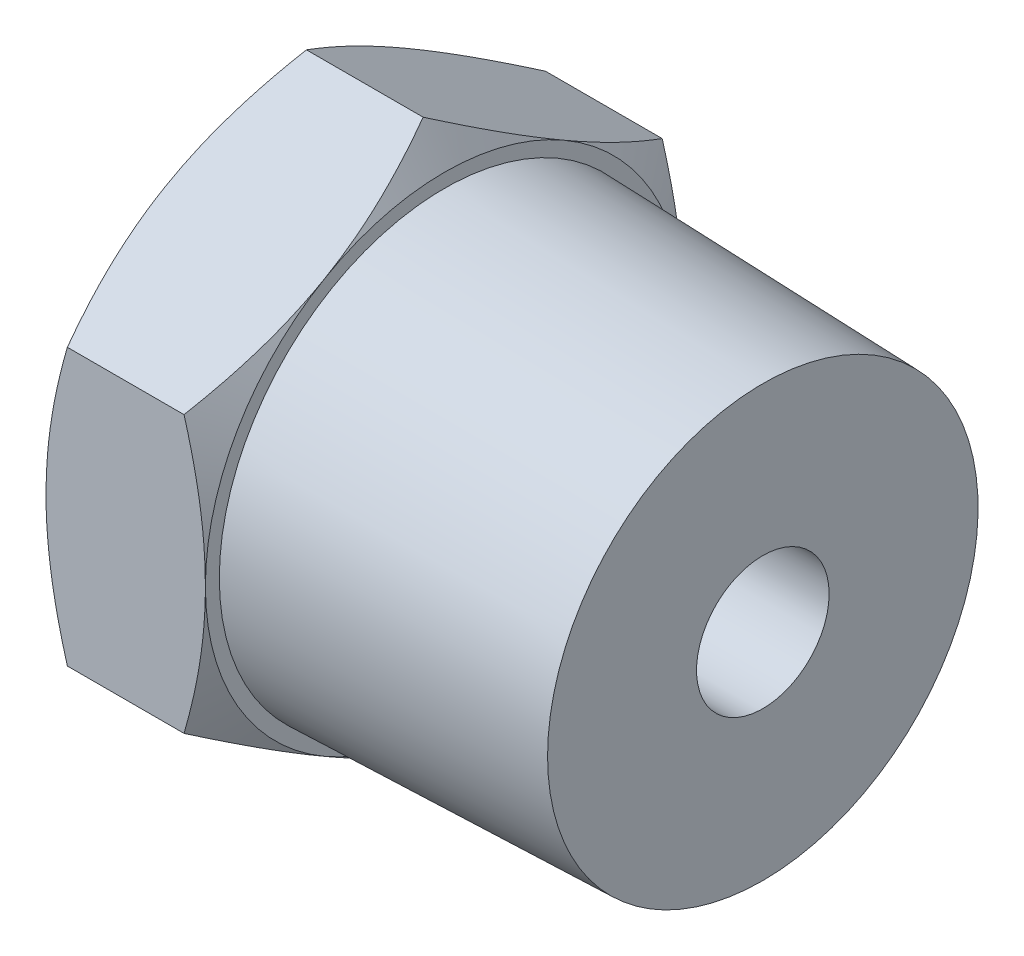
ISO-10303-21;
HEADER;
FILE_DESCRIPTION(('STEP AP214'),'2;1');
FILE_NAME('part.step','',(''),(''),'','','');
FILE_SCHEMA(('AUTOMOTIVE_DESIGN { 1 0 10303 214 1 1 1 1 }'));
ENDSEC;
DATA;
#1=APPLICATION_CONTEXT('core data for automotive mechanical design processes');
#2=APPLICATION_PROTOCOL_DEFINITION('international standard','automotive_design',2000,#1);
#3=PRODUCT_CONTEXT('',#1,'mechanical');
#4=PRODUCT('Part','Part','',(#3));
#5=PRODUCT_RELATED_PRODUCT_CATEGORY('part','',(#4));
#6=PRODUCT_DEFINITION_FORMATION('','',#4);
#7=PRODUCT_DEFINITION_CONTEXT('part definition',#1,'design');
#8=PRODUCT_DEFINITION('design','',#6,#7);
#9=PRODUCT_DEFINITION_SHAPE('','',#8);
#10=(LENGTH_UNIT() NAMED_UNIT(*) SI_UNIT(.MILLI.,.METRE.));
#11=(NAMED_UNIT(*) PLANE_ANGLE_UNIT() SI_UNIT($,.RADIAN.));
#12=(NAMED_UNIT(*) SI_UNIT($,.STERADIAN.) SOLID_ANGLE_UNIT());
#13=UNCERTAINTY_MEASURE_WITH_UNIT(LENGTH_MEASURE(1.E-05),#10,'distance_accuracy_value','');
#14=(GEOMETRIC_REPRESENTATION_CONTEXT(3) GLOBAL_UNCERTAINTY_ASSIGNED_CONTEXT((#13)) GLOBAL_UNIT_ASSIGNED_CONTEXT((#10,
#11,#12)) REPRESENTATION_CONTEXT('',''));
#15=CARTESIAN_POINT('',(0.,0.,0.));
#16=DIRECTION('',(0.,0.,1.));
#17=DIRECTION('',(1.,0.,0.));
#18=AXIS2_PLACEMENT_3D('',#15,#16,#17);
#19=CARTESIAN_POINT('',(0.,8.24889197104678,0.));
#20=DIRECTION('',(-1.,0.,0.));
#21=DIRECTION('',(0.,0.,1.));
#22=AXIS2_PLACEMENT_3D('',#19,#20,#21);
#23=PLANE('',#22);
#24=CARTESIAN_POINT('',(0.,0.,0.));
#25=DIRECTION('',(-1.,0.,0.));
#26=DIRECTION('',(0.,0.,1.));
#27=AXIS2_PLACEMENT_3D('',#24,#25,#26);
#28=CIRCLE('',#27,2.0193);
#29=CARTESIAN_POINT('',(0.,0.,2.0193));
#30=VERTEX_POINT('',#29);
#31=EDGE_CURVE('E392',#30,#30,#28,.T.);
#32=ORIENTED_EDGE('',*,*,#31,.F.);
#33=EDGE_LOOP('',(#32));
#34=FACE_BOUND('',#33,.T.);
#35=CARTESIAN_POINT('',(0.,0.,0.));
#36=DIRECTION('',(1.,0.,0.));
#37=DIRECTION('',(0.,0.,-1.));
#38=AXIS2_PLACEMENT_3D('',#35,#36,#37);
#39=CIRCLE('',#38,7.14375);
#40=CARTESIAN_POINT('',(0.,-6.18666897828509,-3.571875));
#41=VERTEX_POINT('',#40);
#42=CARTESIAN_POINT('',(0.,0.,-7.14375));
#43=VERTEX_POINT('',#42);
#44=EDGE_CURVE('E102',#41,#43,#39,.T.);
#45=ORIENTED_EDGE('',*,*,#44,.F.);
#46=CARTESIAN_POINT('',(0.,0.,0.));
#47=DIRECTION('',(1.,0.,0.));
#48=DIRECTION('',(0.,0.,-1.));
#49=AXIS2_PLACEMENT_3D('',#46,#47,#48);
#50=CIRCLE('',#49,7.14375);
#51=CARTESIAN_POINT('',(0.,-6.18666897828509,3.571875));
#52=VERTEX_POINT('',#51);
#53=EDGE_CURVE('E119',#52,#41,#50,.T.);
#54=ORIENTED_EDGE('',*,*,#53,.F.);
#55=CARTESIAN_POINT('',(0.,0.,0.));
#56=DIRECTION('',(1.,0.,0.));
#57=DIRECTION('',(0.,0.,-1.));
#58=AXIS2_PLACEMENT_3D('',#55,#56,#57);
#59=CIRCLE('',#58,7.14375);
#60=CARTESIAN_POINT('',(0.,0.,7.14375));
#61=VERTEX_POINT('',#60);
#62=EDGE_CURVE('E268',#61,#52,#59,.T.);
#63=ORIENTED_EDGE('',*,*,#62,.F.);
#64=CARTESIAN_POINT('',(0.,0.,0.));
#65=DIRECTION('',(1.,0.,0.));
#66=DIRECTION('',(0.,0.,-1.));
#67=AXIS2_PLACEMENT_3D('',#64,#65,#66);
#68=CIRCLE('',#67,7.14375);
#69=CARTESIAN_POINT('',(0.,6.18666897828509,3.571875));
#70=VERTEX_POINT('',#69);
#71=EDGE_CURVE('E271',#70,#61,#68,.T.);
#72=ORIENTED_EDGE('',*,*,#71,.F.);
#73=CARTESIAN_POINT('',(0.,0.,0.));
#74=DIRECTION('',(1.,0.,0.));
#75=DIRECTION('',(0.,0.,-1.));
#76=AXIS2_PLACEMENT_3D('',#73,#74,#75);
#77=CIRCLE('',#76,7.14375);
#78=CARTESIAN_POINT('',(0.,6.18666897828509,-3.571875));
#79=VERTEX_POINT('',#78);
#80=EDGE_CURVE('E105',#79,#70,#77,.T.);
#81=ORIENTED_EDGE('',*,*,#80,.F.);
#82=CARTESIAN_POINT('',(0.,0.,0.));
#83=DIRECTION('',(1.,0.,0.));
#84=DIRECTION('',(0.,0.,-1.));
#85=AXIS2_PLACEMENT_3D('',#82,#83,#84);
#86=CIRCLE('',#85,7.14375);
#87=EDGE_CURVE('E19',#43,#79,#86,.T.);
#88=ORIENTED_EDGE('',*,*,#87,.F.);
#89=EDGE_LOOP('',(#45,#54,#63,#72,#81,#88));
#90=FACE_BOUND('',#89,.T.);
#91=ADVANCED_FACE('F16',(#34,#90),#23,.T.);
#92=CARTESIAN_POINT('',(0.641882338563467,0.,0.));
#93=DIRECTION('',(1.,0.,0.));
#94=DIRECTION('',(0.,0.,-1.));
#95=AXIS2_PLACEMENT_3D('',#92,#93,#94);
#96=CONICAL_SURFACE('',#95,8.25552282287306,1.0471975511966);
#97=CARTESIAN_POINT('',(0.638054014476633,4.12444598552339,-7.14375));
#98=CARTESIAN_POINT('',(0.541113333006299,4.29231005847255,-6.85300089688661));
#99=CARTESIAN_POINT('',(0.452298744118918,4.4615184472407,-6.5599233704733));
#100=CARTESIAN_POINT('',(0.295675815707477,4.80142677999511,-5.97118486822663));
#101=CARTESIAN_POINT('',(0.227763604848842,4.9721148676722,-5.67554442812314));
#102=CARTESIAN_POINT('',(0.14437893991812,5.22975788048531,-5.22929363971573));
#103=CARTESIAN_POINT('',(0.119654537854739,5.31596434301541,-5.0799796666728));
#104=CARTESIAN_POINT('',(0.0768560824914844,5.4887899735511,-4.78063689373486));
#105=CARTESIAN_POINT('',(0.0587818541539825,5.57540913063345,-4.63060811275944));
#106=CARTESIAN_POINT('',(0.0296013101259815,5.74938054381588,-4.32928078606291));
#107=CARTESIAN_POINT('',(0.0185304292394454,5.8367342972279,-4.17797964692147));
#108=CARTESIAN_POINT('',(0.00371445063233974,6.011613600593,-3.87507980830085));
#109=CARTESIAN_POINT('',(-2.91962400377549E-05,6.0991391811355,-3.72348105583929));
#110=CARTESIAN_POINT('',(0.,6.18666897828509,-3.571875));
#111=B_SPLINE_CURVE_WITH_KNOTS('',3,(#97,#98,#99,#100,#101,#102,#103,#104,#105,#106,#107,#108,
#109,#110),.UNSPECIFIED.,.F.,.F.,(4,2,2,2,2,2,4),(0.,1.04875487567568,2.0922106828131,
2.61462320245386,3.1370219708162,3.66204321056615,4.18716839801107),.UNSPECIFIED.);
#112=CARTESIAN_POINT('',(0.638054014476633,4.12444598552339,-7.14375));
#113=VERTEX_POINT('',#112);
#114=EDGE_CURVE('E124',#113,#79,#111,.T.);
#115=ORIENTED_EDGE('',*,*,#114,.F.);
#116=CARTESIAN_POINT('',(0.,0.,-7.14375));
#117=CARTESIAN_POINT('',(-2.91962400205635E-05,0.175059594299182,-7.14375000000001));
#118=CARTESIAN_POINT('',(0.00371445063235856,0.350110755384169,-7.14375000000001));
#119=CARTESIAN_POINT('',(0.0185304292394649,0.699869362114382,-7.14375000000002));
#120=CARTESIAN_POINT('',(0.029601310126,0.874576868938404,-7.14375000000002));
#121=CARTESIAN_POINT('',(0.0587818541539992,1.22251969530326,-7.14375000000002));
#122=CARTESIAN_POINT('',(0.0768560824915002,1.39575800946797,-7.14375000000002));
#123=CARTESIAN_POINT('',(0.119654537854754,1.74140927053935,-7.14375000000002));
#124=CARTESIAN_POINT('',(0.144378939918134,1.91382219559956,-7.14375000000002));
#125=CARTESIAN_POINT('',(0.227763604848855,2.42910822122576,-7.14375000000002));
#126=CARTESIAN_POINT('',(0.295675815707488,2.77048439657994,-7.14375000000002));
#127=CARTESIAN_POINT('',(0.452298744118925,3.45030106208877,-7.14375000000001));
#128=CARTESIAN_POINT('',(0.541113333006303,3.78871783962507,-7.14375000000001));
#129=CARTESIAN_POINT('',(0.638054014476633,4.12444598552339,-7.14375));
#130=B_SPLINE_CURVE_WITH_KNOTS('',3,(#116,#117,#118,#119,#120,#121,#122,#123,#124,#125,#126,
#127,#128,#129),.UNSPECIFIED.,.F.,.F.,(4,2,2,2,2,2,4),(0.,0.525125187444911,1.05014642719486,
1.5725451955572,2.09495771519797,3.13841352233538,4.18716839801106),.UNSPECIFIED.);
#131=EDGE_CURVE('E121',#43,#113,#130,.T.);
#132=ORIENTED_EDGE('',*,*,#131,.F.);
#133=ORIENTED_EDGE('',*,*,#87,.T.);
#134=EDGE_LOOP('',(#115,#132,#133));
#135=FACE_BOUND('',#134,.T.);
#136=ADVANCED_FACE('F122',(#135),#96,.T.);
#137=CARTESIAN_POINT('',(0.641882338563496,0.,0.));
#138=DIRECTION('',(1.,0.,0.));
#139=DIRECTION('',(0.,0.,-1.));
#140=AXIS2_PLACEMENT_3D('',#137,#138,#139);
#141=CONICAL_SURFACE('',#140,8.25552282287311,1.0471975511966);
#142=CARTESIAN_POINT('',(0.638054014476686,-4.12444598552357,-7.14375));
#143=CARTESIAN_POINT('',(0.54111333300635,-3.78871783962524,-7.14375000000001));
#144=CARTESIAN_POINT('',(0.452298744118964,-3.45030106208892,-7.14375000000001));
#145=CARTESIAN_POINT('',(0.295675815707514,-2.77048439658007,-7.14375000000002));
#146=CARTESIAN_POINT('',(0.227763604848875,-2.42910822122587,-7.14375000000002));
#147=CARTESIAN_POINT('',(0.144378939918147,-1.91382219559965,-7.14375000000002));
#148=CARTESIAN_POINT('',(0.119654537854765,-1.74140927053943,-7.14375000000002));
#149=CARTESIAN_POINT('',(0.0768560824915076,-1.39575800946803,-7.14375000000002));
#150=CARTESIAN_POINT('',(0.0587818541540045,-1.22251969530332,-7.14375000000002));
#151=CARTESIAN_POINT('',(0.0296013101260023,-0.874576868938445,-7.14375000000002));
#152=CARTESIAN_POINT('',(0.0185304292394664,-0.699869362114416,-7.14375000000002));
#153=CARTESIAN_POINT('',(0.0037144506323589,-0.350110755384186,-7.14375000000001));
#154=CARTESIAN_POINT('',(-2.91962400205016E-05,-0.175059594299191,-7.14375000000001));
#155=CARTESIAN_POINT('',(0.,0.,-7.14375));
#156=B_SPLINE_CURVE_WITH_KNOTS('',3,(#142,#143,#144,#145,#146,#147,#148,#149,#150,#151,#152,
#153,#154,#155),.UNSPECIFIED.,.F.,.F.,(4,2,2,2,2,2,4),(0.,1.04875487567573,2.09221068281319,
2.61462320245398,3.13702197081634,3.66204321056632,4.18716839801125),.UNSPECIFIED.);
#157=CARTESIAN_POINT('',(0.638054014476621,-4.12444598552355,-7.14374999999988));
#158=VERTEX_POINT('',#157);
#159=EDGE_CURVE('E114',#158,#43,#156,.T.);
#160=ORIENTED_EDGE('',*,*,#159,.F.);
#161=CARTESIAN_POINT('',(0.,-6.18666897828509,-3.571875));
#162=CARTESIAN_POINT('',(-2.91962400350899E-05,-6.09913918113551,-3.72348105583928));
#163=CARTESIAN_POINT('',(0.00371445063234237,-6.01161360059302,-3.87507980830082));
#164=CARTESIAN_POINT('',(0.0185304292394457,-5.83673429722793,-4.17797964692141));
#165=CARTESIAN_POINT('',(0.0296013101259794,-5.74938054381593,-4.32928078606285));
#166=CARTESIAN_POINT('',(0.0587818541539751,-5.57540913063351,-4.63060811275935));
#167=CARTESIAN_POINT('',(0.076856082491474,-5.48878997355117,-4.78063689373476));
#168=CARTESIAN_POINT('',(0.119654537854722,-5.31596434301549,-5.07997966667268));
#169=CARTESIAN_POINT('',(0.144378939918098,-5.22975788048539,-5.22929363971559));
#170=CARTESIAN_POINT('',(0.227763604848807,-4.97211486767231,-5.67554442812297));
#171=CARTESIAN_POINT('',(0.29567581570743,-4.80142677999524,-5.97118486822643));
#172=CARTESIAN_POINT('',(0.452298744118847,-4.46151844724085,-6.55992337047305));
#173=CARTESIAN_POINT('',(0.541113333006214,-4.29231005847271,-6.85300089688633));
#174=CARTESIAN_POINT('',(0.638054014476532,-4.12444598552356,-7.1437499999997));
#175=B_SPLINE_CURVE_WITH_KNOTS('',3,(#161,#162,#163,#164,#165,#166,#167,#168,#169,#170,#171,
#172,#173,#174),.UNSPECIFIED.,.F.,.F.,(4,2,2,2,2,2,4),(0.,0.525125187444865,1.05014642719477,
1.57254519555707,2.09495771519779,3.13841352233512,4.1871683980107),.UNSPECIFIED.);
#176=EDGE_CURVE('E117',#41,#158,#175,.T.);
#177=ORIENTED_EDGE('',*,*,#176,.F.);
#178=ORIENTED_EDGE('',*,*,#44,.T.);
#179=EDGE_LOOP('',(#160,#177,#178));
#180=FACE_BOUND('',#179,.T.);
#181=ADVANCED_FACE('F112',(#180),#141,.T.);
#182=CARTESIAN_POINT('',(0.641882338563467,0.,0.));
#183=DIRECTION('',(1.,0.,0.));
#184=DIRECTION('',(0.,0.,-1.));
#185=AXIS2_PLACEMENT_3D('',#182,#183,#184);
#186=CONICAL_SURFACE('',#185,8.25552282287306,1.0471975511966);
#187=CARTESIAN_POINT('',(0.638054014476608,-8.24889197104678,0.));
#188=CARTESIAN_POINT('',(0.541113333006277,-8.08102789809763,-0.290749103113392));
#189=CARTESIAN_POINT('',(0.452298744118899,-7.91181950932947,-0.583826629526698));
#190=CARTESIAN_POINT('',(0.295675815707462,-7.57191117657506,-1.17256513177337));
#191=CARTESIAN_POINT('',(0.227763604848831,-7.40122308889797,-1.46820557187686));
#192=CARTESIAN_POINT('',(0.144378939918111,-7.14358007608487,-1.91445636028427));
#193=CARTESIAN_POINT('',(0.119654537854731,-7.05737361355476,-2.0637703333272));
#194=CARTESIAN_POINT('',(0.0768560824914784,-6.88454798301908,-2.36311310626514));
#195=CARTESIAN_POINT('',(0.0587818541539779,-6.79792882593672,-2.51314188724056));
#196=CARTESIAN_POINT('',(0.0296013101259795,-6.62395741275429,-2.81446921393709));
#197=CARTESIAN_POINT('',(0.0185304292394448,-6.53660365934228,-2.96577035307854));
#198=CARTESIAN_POINT('',(0.0037144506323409,-6.36172435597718,-3.26867019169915));
#199=CARTESIAN_POINT('',(-2.91962400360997E-05,-6.27419877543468,-3.42026894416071));
#200=CARTESIAN_POINT('',(0.,-6.18666897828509,-3.571875));
#201=B_SPLINE_CURVE_WITH_KNOTS('',3,(#187,#188,#189,#190,#191,#192,#193,#194,#195,#196,#197,
#198,#199,#200),.UNSPECIFIED.,.F.,.F.,(4,2,2,2,2,2,4),(0.,1.04875487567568,2.09221068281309,
2.61462320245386,3.1370219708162,3.66204321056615,4.18716839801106),.UNSPECIFIED.);
#202=CARTESIAN_POINT('',(0.638054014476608,-8.24889197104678,0.));
#203=VERTEX_POINT('',#202);
#204=EDGE_CURVE('E167',#203,#41,#201,.T.);
#205=ORIENTED_EDGE('',*,*,#204,.F.);
#206=CARTESIAN_POINT('',(0.,-6.18666897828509,3.571875));
#207=CARTESIAN_POINT('',(-2.91962400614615E-05,-6.27419877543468,3.42026894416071));
#208=CARTESIAN_POINT('',(0.00371445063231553,-6.36172435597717,3.26867019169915));
#209=CARTESIAN_POINT('',(0.0185304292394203,-6.53660365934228,2.96577035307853));
#210=CARTESIAN_POINT('',(0.029601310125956,-6.62395741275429,2.81446921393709));
#211=CARTESIAN_POINT('',(0.058781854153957,-6.79792882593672,2.51314188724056));
#212=CARTESIAN_POINT('',(0.0768560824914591,-6.88454798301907,2.36311310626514));
#213=CARTESIAN_POINT('',(0.119654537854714,-7.05737361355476,2.0637703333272));
#214=CARTESIAN_POINT('',(0.144378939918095,-7.14358007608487,1.91445636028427));
#215=CARTESIAN_POINT('',(0.227763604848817,-7.40122308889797,1.46820557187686));
#216=CARTESIAN_POINT('',(0.295675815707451,-7.57191117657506,1.17256513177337));
#217=CARTESIAN_POINT('',(0.452298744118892,-7.91181950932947,0.583826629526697));
#218=CARTESIAN_POINT('',(0.541113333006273,-8.08102789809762,0.290749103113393));
#219=CARTESIAN_POINT('',(0.638054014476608,-8.24889197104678,0.));
#220=B_SPLINE_CURVE_WITH_KNOTS('',3,(#206,#207,#208,#209,#210,#211,#212,#213,#214,#215,#216,
#217,#218,#219),.UNSPECIFIED.,.F.,.F.,(4,2,2,2,2,2,4),(0.,0.525125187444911,1.05014642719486,
1.5725451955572,2.09495771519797,3.13841352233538,4.18716839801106),.UNSPECIFIED.);
#221=EDGE_CURVE('E279',#52,#203,#220,.T.);
#222=ORIENTED_EDGE('',*,*,#221,.F.);
#223=ORIENTED_EDGE('',*,*,#53,.T.);
#224=EDGE_LOOP('',(#205,#222,#223));
#225=FACE_BOUND('',#224,.T.);
#226=ADVANCED_FACE('F157',(#225),#186,.T.);
#227=CARTESIAN_POINT('',(0.641882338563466,0.,0.));
#228=DIRECTION('',(1.,0.,0.));
#229=DIRECTION('',(0.,0.,-1.));
#230=AXIS2_PLACEMENT_3D('',#227,#228,#229);
#231=CONICAL_SURFACE('',#230,8.25552282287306,1.0471975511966);
#232=ORIENTED_EDGE('',*,*,#80,.T.);
#233=CARTESIAN_POINT('',(0.638054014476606,8.24889197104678,0.));
#234=CARTESIAN_POINT('',(0.541113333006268,8.08102789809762,0.290749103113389));
#235=CARTESIAN_POINT('',(0.452298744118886,7.91181950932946,0.583826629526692));
#236=CARTESIAN_POINT('',(0.295675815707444,7.57191117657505,1.17256513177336));
#237=CARTESIAN_POINT('',(0.227763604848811,7.40122308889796,1.46820557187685));
#238=CARTESIAN_POINT('',(0.144378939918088,7.14358007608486,1.91445636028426));
#239=CARTESIAN_POINT('',(0.119654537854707,7.05737361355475,2.06377033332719));
#240=CARTESIAN_POINT('',(0.0768560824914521,6.88454798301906,2.36311310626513));
#241=CARTESIAN_POINT('',(0.0587818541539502,6.79792882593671,2.51314188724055));
#242=CARTESIAN_POINT('',(0.029601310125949,6.62395741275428,2.81446921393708));
#243=CARTESIAN_POINT('',(0.0185304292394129,6.53660365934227,2.96577035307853));
#244=CARTESIAN_POINT('',(0.00371445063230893,6.36172435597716,3.26867019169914));
#245=CARTESIAN_POINT('',(-2.91962400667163E-05,6.27419877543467,3.42026894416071));
#246=CARTESIAN_POINT('',(0.,6.18666897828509,3.571875));
#247=B_SPLINE_CURVE_WITH_KNOTS('',3,(#233,#234,#235,#236,#237,#238,#239,#240,#241,#242,#243,
#244,#245,#246),.UNSPECIFIED.,.F.,.F.,(4,2,2,2,2,2,4),(0.,1.04875487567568,2.09221068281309,
2.61462320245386,3.1370219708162,3.66204321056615,4.18716839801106),.UNSPECIFIED.);
#248=CARTESIAN_POINT('',(0.638054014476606,8.24889197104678,0.));
#249=VERTEX_POINT('',#248);
#250=EDGE_CURVE('E322',#249,#70,#247,.T.);
#251=ORIENTED_EDGE('',*,*,#250,.F.);
#252=CARTESIAN_POINT('',(0.,6.18666897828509,-3.571875));
#253=CARTESIAN_POINT('',(-2.91962400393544E-05,6.27419877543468,-3.42026894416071));
#254=CARTESIAN_POINT('',(0.00371445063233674,6.36172435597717,-3.26867019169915));
#255=CARTESIAN_POINT('',(0.01853042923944,6.53660365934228,-2.96577035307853));
#256=CARTESIAN_POINT('',(0.029601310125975,6.62395741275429,-2.81446921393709));
#257=CARTESIAN_POINT('',(0.058781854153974,6.79792882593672,-2.51314188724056));
#258=CARTESIAN_POINT('',(0.0768560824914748,6.88454798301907,-2.36311310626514));
#259=CARTESIAN_POINT('',(0.119654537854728,7.05737361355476,-2.0637703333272));
#260=CARTESIAN_POINT('',(0.144378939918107,7.14358007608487,-1.91445636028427));
#261=CARTESIAN_POINT('',(0.227763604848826,7.40122308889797,-1.46820557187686));
#262=CARTESIAN_POINT('',(0.295675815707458,7.57191117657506,-1.17256513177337));
#263=CARTESIAN_POINT('',(0.452298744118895,7.91181950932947,-0.583826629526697));
#264=CARTESIAN_POINT('',(0.541113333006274,8.08102789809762,-0.290749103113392));
#265=CARTESIAN_POINT('',(0.638054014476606,8.24889197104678,0.));
#266=B_SPLINE_CURVE_WITH_KNOTS('',3,(#252,#253,#254,#255,#256,#257,#258,#259,#260,#261,#262,
#263,#264,#265),.UNSPECIFIED.,.F.,.F.,(4,2,2,2,2,2,4),(0.,0.52512518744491,1.05014642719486,
1.5725451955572,2.09495771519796,3.13841352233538,4.18716839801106),.UNSPECIFIED.);
#267=EDGE_CURVE('E134',#79,#249,#266,.T.);
#268=ORIENTED_EDGE('',*,*,#267,.F.);
#269=EDGE_LOOP('',(#232,#251,#268));
#270=FACE_BOUND('',#269,.T.);
#271=ADVANCED_FACE('F316',(#270),#231,.T.);
#272=CARTESIAN_POINT('',(0.641882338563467,0.,0.));
#273=DIRECTION('',(1.,0.,0.));
#274=DIRECTION('',(0.,0.,-1.));
#275=AXIS2_PLACEMENT_3D('',#272,#273,#274);
#276=CONICAL_SURFACE('',#275,8.25552282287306,1.0471975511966);
#277=CARTESIAN_POINT('',(0.638054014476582,4.12444598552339,7.14375));
#278=CARTESIAN_POINT('',(0.541113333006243,3.78871783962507,7.14374999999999));
#279=CARTESIAN_POINT('',(0.452298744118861,3.45030106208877,7.14374999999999));
#280=CARTESIAN_POINT('',(0.29567581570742,2.77048439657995,7.14374999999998));
#281=CARTESIAN_POINT('',(0.227763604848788,2.42910822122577,7.14374999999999));
#282=CARTESIAN_POINT('',(0.144378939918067,1.91382219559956,7.14374999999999));
#283=CARTESIAN_POINT('',(0.119654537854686,1.74140927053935,7.14374999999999));
#284=CARTESIAN_POINT('',(0.0768560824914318,1.39575800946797,7.14374999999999));
#285=CARTESIAN_POINT('',(0.0587818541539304,1.22251969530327,7.14374999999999));
#286=CARTESIAN_POINT('',(0.0296013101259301,0.874576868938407,7.14374999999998));
#287=CARTESIAN_POINT('',(0.0185304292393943,0.699869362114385,7.14374999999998));
#288=CARTESIAN_POINT('',(0.00371445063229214,0.350110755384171,7.14374999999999));
#289=CARTESIAN_POINT('',(-2.91962400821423E-05,0.175059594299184,7.14374999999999));
#290=CARTESIAN_POINT('',(0.,0.,7.14375));
#291=B_SPLINE_CURVE_WITH_KNOTS('',3,(#277,#278,#279,#280,#281,#282,#283,#284,#285,#286,#287,
#288,#289,#290),.UNSPECIFIED.,.F.,.F.,(4,2,2,2,2,2,4),(0.,1.04875487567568,2.0922106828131,
2.61462320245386,3.1370219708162,3.66204321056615,4.18716839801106),.UNSPECIFIED.);
#292=CARTESIAN_POINT('',(0.638054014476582,4.12444598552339,7.14375));
#293=VERTEX_POINT('',#292);
#294=EDGE_CURVE('E287',#293,#61,#291,.T.);
#295=ORIENTED_EDGE('',*,*,#294,.F.);
#296=CARTESIAN_POINT('',(0.,6.18666897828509,3.571875));
#297=CARTESIAN_POINT('',(-2.91962400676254E-05,6.09913918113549,3.72348105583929));
#298=CARTESIAN_POINT('',(0.00371445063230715,6.01161360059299,3.87507980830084));
#299=CARTESIAN_POINT('',(0.0185304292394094,5.83673429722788,4.17797964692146));
#300=CARTESIAN_POINT('',(0.0296013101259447,5.74938054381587,4.32928078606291));
#301=CARTESIAN_POINT('',(0.0587818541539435,5.57540913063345,4.63060811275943));
#302=CARTESIAN_POINT('',(0.0768560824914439,5.48878997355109,4.78063689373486));
#303=CARTESIAN_POINT('',(0.119654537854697,5.3159643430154,5.0799796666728));
#304=CARTESIAN_POINT('',(0.144378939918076,5.2297578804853,5.22929363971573));
#305=CARTESIAN_POINT('',(0.227763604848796,4.97211486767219,5.67554442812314));
#306=CARTESIAN_POINT('',(0.295675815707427,4.8014267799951,5.97118486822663));
#307=CARTESIAN_POINT('',(0.452298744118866,4.46151844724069,6.5599233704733));
#308=CARTESIAN_POINT('',(0.541113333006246,4.29231005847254,6.85300089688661));
#309=CARTESIAN_POINT('',(0.638054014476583,4.12444598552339,7.14375));
#310=B_SPLINE_CURVE_WITH_KNOTS('',3,(#296,#297,#298,#299,#300,#301,#302,#303,#304,#305,#306,
#307,#308,#309),.UNSPECIFIED.,.F.,.F.,(4,2,2,2,2,2,4),(0.,0.525125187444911,1.05014642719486,
1.5725451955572,2.09495771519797,3.13841352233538,4.18716839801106),.UNSPECIFIED.);
#311=EDGE_CURVE('E306',#70,#293,#310,.T.);
#312=ORIENTED_EDGE('',*,*,#311,.F.);
#313=ORIENTED_EDGE('',*,*,#71,.T.);
#314=EDGE_LOOP('',(#295,#312,#313));
#315=FACE_BOUND('',#314,.T.);
#316=ADVANCED_FACE('F313',(#315),#276,.T.);
#317=CARTESIAN_POINT('',(0.641882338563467,0.,0.));
#318=DIRECTION('',(1.,0.,0.));
#319=DIRECTION('',(0.,0.,-1.));
#320=AXIS2_PLACEMENT_3D('',#317,#318,#319);
#321=CONICAL_SURFACE('',#320,8.25552282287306,1.0471975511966);
#322=CARTESIAN_POINT('',(0.638054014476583,-4.1244459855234,7.14375));
#323=CARTESIAN_POINT('',(0.541113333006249,-4.29231005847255,6.85300089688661));
#324=CARTESIAN_POINT('',(0.45229874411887,-4.4615184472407,6.5599233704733));
#325=CARTESIAN_POINT('',(0.295675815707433,-4.80142677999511,5.97118486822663));
#326=CARTESIAN_POINT('',(0.227763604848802,-4.97211486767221,5.67554442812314));
#327=CARTESIAN_POINT('',(0.144378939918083,-5.22975788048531,5.22929363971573));
#328=CARTESIAN_POINT('',(0.119654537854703,-5.31596434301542,5.0799796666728));
#329=CARTESIAN_POINT('',(0.0768560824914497,-5.4887899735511,4.78063689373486));
#330=CARTESIAN_POINT('',(0.0587818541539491,-5.57540913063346,4.63060811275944));
#331=CARTESIAN_POINT('',(0.0296013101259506,-5.74938054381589,4.32928078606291));
#332=CARTESIAN_POINT('',(0.0185304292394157,-5.8367342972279,4.17797964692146));
#333=CARTESIAN_POINT('',(0.00371445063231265,-6.011613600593,3.87507980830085));
#334=CARTESIAN_POINT('',(-2.91962400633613E-05,-6.0991391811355,3.72348105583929));
#335=CARTESIAN_POINT('',(0.,-6.18666897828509,3.571875));
#336=B_SPLINE_CURVE_WITH_KNOTS('',3,(#322,#323,#324,#325,#326,#327,#328,#329,#330,#331,#332,
#333,#334,#335),.UNSPECIFIED.,.F.,.F.,(4,2,2,2,2,2,4),(0.,1.04875487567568,2.09221068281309,
2.61462320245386,3.1370219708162,3.66204321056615,4.18716839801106),.UNSPECIFIED.);
#337=CARTESIAN_POINT('',(0.638054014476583,-4.1244459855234,7.14375));
#338=VERTEX_POINT('',#337);
#339=EDGE_CURVE('E168',#338,#52,#336,.T.);
#340=ORIENTED_EDGE('',*,*,#339,.F.);
#341=CARTESIAN_POINT('',(0.,0.,7.14375));
#342=CARTESIAN_POINT('',(-2.91962400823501E-05,-0.175059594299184,7.14374999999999));
#343=CARTESIAN_POINT('',(0.00371445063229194,-0.350110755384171,7.14374999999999));
#344=CARTESIAN_POINT('',(0.0185304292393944,-0.699869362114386,7.14374999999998));
#345=CARTESIAN_POINT('',(0.0296013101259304,-0.874576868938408,7.14374999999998));
#346=CARTESIAN_POINT('',(0.0587818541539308,-1.22251969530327,7.14374999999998));
#347=CARTESIAN_POINT('',(0.0768560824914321,-1.39575800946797,7.14374999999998));
#348=CARTESIAN_POINT('',(0.119654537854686,-1.74140927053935,7.14374999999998));
#349=CARTESIAN_POINT('',(0.144378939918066,-1.91382219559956,7.14374999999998));
#350=CARTESIAN_POINT('',(0.227763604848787,-2.42910822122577,7.14374999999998));
#351=CARTESIAN_POINT('',(0.29567581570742,-2.77048439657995,7.14374999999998));
#352=CARTESIAN_POINT('',(0.452298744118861,-3.45030106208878,7.14374999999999));
#353=CARTESIAN_POINT('',(0.541113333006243,-3.78871783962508,7.14374999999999));
#354=CARTESIAN_POINT('',(0.638054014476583,-4.1244459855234,7.14375));
#355=B_SPLINE_CURVE_WITH_KNOTS('',3,(#341,#342,#343,#344,#345,#346,#347,#348,#349,#350,#351,
#352,#353,#354),.UNSPECIFIED.,.F.,.F.,(4,2,2,2,2,2,4),(0.,0.525125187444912,1.05014642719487,
1.5725451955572,2.09495771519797,3.13841352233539,4.18716839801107),.UNSPECIFIED.);
#356=EDGE_CURVE('E285',#61,#338,#355,.T.);
#357=ORIENTED_EDGE('',*,*,#356,.F.);
#358=ORIENTED_EDGE('',*,*,#62,.T.);
#359=EDGE_LOOP('',(#340,#357,#358));
#360=FACE_BOUND('',#359,.T.);
#361=ADVANCED_FACE('F252',(#360),#321,.T.);
#362=CARTESIAN_POINT('',(4.7625,8.24889197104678,0.));
#363=DIRECTION('',(0.,0.866025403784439,-0.5));
#364=DIRECTION('',(0.,-0.5,-0.866025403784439));
#365=AXIS2_PLACEMENT_3D('',#362,#363,#364);
#366=PLANE('',#365);
#367=ORIENTED_EDGE('',*,*,#114,.T.);
#368=ORIENTED_EDGE('',*,*,#267,.T.);
#369=DIRECTION('',(-1.,0.,0.));
#370=VECTOR('',#369,1.);
#371=CARTESIAN_POINT('',(4.7625,8.24889197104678,0.));
#372=LINE('',#371,#370);
#373=CARTESIAN_POINT('',(4.12444598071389,8.24889197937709,-1.44285053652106E-08));
#374=VERTEX_POINT('',#373);
#375=EDGE_CURVE('E327',#374,#249,#372,.T.);
#376=ORIENTED_EDGE('',*,*,#375,.F.);
#377=CARTESIAN_POINT('',(4.7625,6.18666897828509,-3.571875));
#378=CARTESIAN_POINT('',(4.76252919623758,6.27419877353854,-3.42026894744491));
#379=CARTESIAN_POINT('',(4.75878554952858,6.36172435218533,-3.2686701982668));
#380=CARTESIAN_POINT('',(4.74396957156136,6.53660365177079,-2.96577036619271));
#381=CARTESIAN_POINT('',(4.73289869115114,6.62395740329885,-2.81446923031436));
#382=CARTESIAN_POINT('',(4.70371814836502,6.79792881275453,-2.51314191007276));
#383=CARTESIAN_POINT('',(4.68564392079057,6.88454796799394,-2.36311313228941));
#384=CARTESIAN_POINT('',(4.64284546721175,7.05737359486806,-2.0637703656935));
#385=CARTESIAN_POINT('',(4.61812106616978,7.14358005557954,-1.91445639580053));
#386=CARTESIAN_POINT('',(4.53473640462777,7.401223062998,-1.4682056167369));
#387=CARTESIAN_POINT('',(4.46682419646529,7.57191114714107,-1.17256518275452));
#388=CARTESIAN_POINT('',(4.310201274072,7.91181947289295,-0.583826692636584));
#389=CARTESIAN_POINT('',(4.22138668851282,8.08102785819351,-0.29074917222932));
#390=CARTESIAN_POINT('',(4.12444601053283,8.24889192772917,-7.5028281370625E-08));
#391=B_SPLINE_CURVE_WITH_KNOTS('',3,(#377,#378,#379,#380,#381,#382,#383,#384,#385,#386,#387,
#388,#389,#390),.UNSPECIFIED.,.F.,.F.,(4,2,2,2,2,2,4),(0.,0.525125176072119,1.05014640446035,
1.57254516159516,2.09495767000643,3.13841345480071,4.18716830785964),.UNSPECIFIED.);
#392=CARTESIAN_POINT('',(4.7625,6.18666897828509,-3.571875));
#393=VERTEX_POINT('',#392);
#394=EDGE_CURVE('E258',#393,#374,#391,.T.);
#395=ORIENTED_EDGE('',*,*,#394,.F.);
#396=CARTESIAN_POINT('',(4.12444601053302,4.12444602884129,-7.14374992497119));
#397=CARTESIAN_POINT('',(4.22138668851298,4.29231009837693,-6.85300082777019));
#398=CARTESIAN_POINT('',(4.31020127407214,4.46151848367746,-6.55992330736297));
#399=CARTESIAN_POINT('',(4.46682419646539,4.8014268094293,-5.97118481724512));
#400=CARTESIAN_POINT('',(4.53473640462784,4.97211489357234,-5.67554438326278));
#401=CARTESIAN_POINT('',(4.61812106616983,5.22975790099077,-5.22929360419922));
#402=CARTESIAN_POINT('',(4.6428454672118,5.31596436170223,-5.07997963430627));
#403=CARTESIAN_POINT('',(4.6856439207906,5.48878998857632,-4.7806368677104));
#404=CARTESIAN_POINT('',(4.70371814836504,5.57540914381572,-4.63060808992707));
#405=CARTESIAN_POINT('',(4.73289869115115,5.74938055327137,-4.32928076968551));
#406=CARTESIAN_POINT('',(4.74396957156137,5.83673430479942,-4.17797963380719));
#407=CARTESIAN_POINT('',(4.75878554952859,6.01161360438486,-3.87507980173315));
#408=CARTESIAN_POINT('',(4.76252919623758,6.09913918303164,-3.72348105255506));
#409=CARTESIAN_POINT('',(4.7625,6.18666897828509,-3.571875));
#410=B_SPLINE_CURVE_WITH_KNOTS('',3,(#396,#397,#398,#399,#400,#401,#402,#403,#404,#405,#406,
#407,#408,#409),.UNSPECIFIED.,.F.,.F.,(4,2,2,2,2,2,4),(0.,1.04875485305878,2.0922106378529,
2.61462314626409,3.13702190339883,3.66204313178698,4.18716830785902),.UNSPECIFIED.);
#411=CARTESIAN_POINT('',(4.12444599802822,4.12444600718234,-7.14374996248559));
#412=VERTEX_POINT('',#411);
#413=EDGE_CURVE('E238',#412,#393,#410,.T.);
#414=ORIENTED_EDGE('',*,*,#413,.F.);
#415=DIRECTION('',(-1.,0.,0.));
#416=VECTOR('',#415,1.);
#417=CARTESIAN_POINT('',(4.7625,4.12444598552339,-7.14375));
#418=LINE('',#417,#416);
#419=EDGE_CURVE('E132',#113,#412,#418,.F.);
#420=ORIENTED_EDGE('',*,*,#419,.F.);
#421=EDGE_LOOP('',(#367,#368,#376,#395,#414,#420));
#422=FACE_BOUND('',#421,.T.);
#423=ADVANCED_FACE('F249',(#422),#366,.T.);
#424=CARTESIAN_POINT('',(4.7625,4.12444598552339,-7.14375));
#425=DIRECTION('',(0.,0.,-1.));
#426=DIRECTION('',(-1.,0.,0.));
#427=AXIS2_PLACEMENT_3D('',#424,#425,#426);
#428=PLANE('',#427);
#429=ORIENTED_EDGE('',*,*,#159,.T.);
#430=ORIENTED_EDGE('',*,*,#131,.T.);
#431=ORIENTED_EDGE('',*,*,#419,.T.);
#432=CARTESIAN_POINT('',(4.7625,0.,-7.14375));
#433=CARTESIAN_POINT('',(4.76252919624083,0.175059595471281,-7.14375));
#434=CARTESIAN_POINT('',(4.75878554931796,0.350110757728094,-7.14375));
#435=CARTESIAN_POINT('',(4.74396957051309,0.699869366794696,-7.14375));
#436=CARTESIAN_POINT('',(4.73289868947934,0.874576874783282,-7.14375));
#437=CARTESIAN_POINT('',(4.7037181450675,1.22251970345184,-7.14375));
#438=CARTESIAN_POINT('',(4.68564391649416,1.39575801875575,-7.14375));
#439=CARTESIAN_POINT('',(4.64284546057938,1.74140928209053,-7.14375));
#440=CARTESIAN_POINT('',(4.61812105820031,1.91382220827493,-7.14375));
#441=CARTESIAN_POINT('',(4.53473639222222,2.42910823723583,-7.14375));
#442=CARTESIAN_POINT('',(4.46682418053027,2.77048441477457,-7.14375));
#443=CARTESIAN_POINT('',(4.31020125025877,3.45030108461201,-7.14375));
#444=CARTESIAN_POINT('',(4.22138666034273,3.7887178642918,-7.14375));
#445=CARTESIAN_POINT('',(4.12444597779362,4.12444601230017,-7.14375));
#446=B_SPLINE_CURVE_WITH_KNOTS('',3,(#432,#433,#434,#435,#436,#437,#438,#439,#440,#441,#442,
#443,#444,#445),.UNSPECIFIED.,.F.,.F.,(4,2,2,2,2,2,4),(0.,0.525125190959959,1.05014643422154,
1.57254520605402,2.09495772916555,3.13841354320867,4.18716842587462),.UNSPECIFIED.);
#447=CARTESIAN_POINT('',(4.7625,0.,-7.14375));
#448=VERTEX_POINT('',#447);
#449=EDGE_CURVE('E232',#448,#412,#446,.T.);
#450=ORIENTED_EDGE('',*,*,#449,.F.);
#451=CARTESIAN_POINT('',(4.12444601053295,-4.12444589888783,-7.14375));
#452=CARTESIAN_POINT('',(4.22138668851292,-3.78871775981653,-7.14375));
#453=CARTESIAN_POINT('',(4.31020127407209,-3.45030098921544,-7.14375));
#454=CARTESIAN_POINT('',(4.46682419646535,-2.77048433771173,-7.14375));
#455=CARTESIAN_POINT('',(4.53473640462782,-2.42910816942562,-7.14375));
#456=CARTESIAN_POINT('',(4.61812106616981,-1.91382215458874,-7.14375));
#457=CARTESIAN_POINT('',(4.64284546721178,-1.7414092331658,-7.14375));
#458=CARTESIAN_POINT('',(4.68564392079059,-1.3957579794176,-7.14375));
#459=CARTESIAN_POINT('',(4.70371814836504,-1.22251966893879,-7.14375));
#460=CARTESIAN_POINT('',(4.73289869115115,-0.874576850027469,-7.14375));
#461=CARTESIAN_POINT('',(4.74396957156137,-0.699869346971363,-7.14375));
#462=CARTESIAN_POINT('',(4.75878554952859,-0.350110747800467,-7.14375));
#463=CARTESIAN_POINT('',(4.76252919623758,-0.175059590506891,-7.14375));
#464=CARTESIAN_POINT('',(4.7625,0.,-7.14375));
#465=B_SPLINE_CURVE_WITH_KNOTS('',3,(#451,#452,#453,#454,#455,#456,#457,#458,#459,#460,#461,
#462,#463,#464),.UNSPECIFIED.,.F.,.F.,(4,2,2,2,2,2,4),(0.,1.04875485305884,2.09221063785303,
2.61462314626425,3.13702190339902,3.6620431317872,4.18716830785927),.UNSPECIFIED.);
#466=CARTESIAN_POINT('',(4.12444599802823,-4.12444594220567,-7.14374999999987));
#467=VERTEX_POINT('',#466);
#468=EDGE_CURVE('E226',#467,#448,#465,.T.);
#469=ORIENTED_EDGE('',*,*,#468,.F.);
#470=DIRECTION('',(-1.,0.,0.));
#471=VECTOR('',#470,1.);
#472=CARTESIAN_POINT('',(4.7625,-4.12444598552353,-7.14374999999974));
#473=LINE('',#472,#471);
#474=EDGE_CURVE('E128',#158,#467,#473,.F.);
#475=ORIENTED_EDGE('',*,*,#474,.F.);
#476=EDGE_LOOP('',(#429,#430,#431,#450,#469,#475));
#477=FACE_BOUND('',#476,.T.);
#478=ADVANCED_FACE('F130',(#477),#428,.T.);
#479=CARTESIAN_POINT('',(4.7625,-4.12444598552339,-7.14375));
#480=DIRECTION('',(0.,-0.866025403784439,-0.5));
#481=DIRECTION('',(0.,-0.5,0.866025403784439));
#482=AXIS2_PLACEMENT_3D('',#479,#480,#481);
#483=PLANE('',#482);
#484=ORIENTED_EDGE('',*,*,#204,.T.);
#485=ORIENTED_EDGE('',*,*,#176,.T.);
#486=ORIENTED_EDGE('',*,*,#474,.T.);
#487=CARTESIAN_POINT('',(4.7625,-6.18666897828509,-3.571875));
#488=CARTESIAN_POINT('',(4.76252919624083,-6.09913918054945,-3.72348105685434));
#489=CARTESIAN_POINT('',(4.75878554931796,-6.01161359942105,-3.87507981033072));
#490=CARTESIAN_POINT('',(4.74396957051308,-5.83673429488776,-4.17797965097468));
#491=CARTESIAN_POINT('',(4.73289868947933,-5.74938054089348,-4.32928079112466));
#492=CARTESIAN_POINT('',(4.7037181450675,-5.57540912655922,-4.63060811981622));
#493=CARTESIAN_POINT('',(4.68564391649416,-5.48878996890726,-4.78063690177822));
#494=CARTESIAN_POINT('',(4.64284546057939,-5.31596433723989,-5.0799796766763));
#495=CARTESIAN_POINT('',(4.61812105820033,-5.22975787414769,-5.22929365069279));
#496=CARTESIAN_POINT('',(4.53473639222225,-4.97211485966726,-5.6755444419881));
#497=CARTESIAN_POINT('',(4.46682418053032,-4.80142677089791,-5.97118488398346));
#498=CARTESIAN_POINT('',(4.31020125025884,-4.46151843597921,-6.55992338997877));
#499=CARTESIAN_POINT('',(4.22138666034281,-4.29231004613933,-6.85300091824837));
#500=CARTESIAN_POINT('',(4.12444597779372,-4.12444597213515,-7.1437500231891));
#501=B_SPLINE_CURVE_WITH_KNOTS('',3,(#487,#488,#489,#490,#491,#492,#493,#494,#495,#496,#497,
#498,#499,#500),.UNSPECIFIED.,.F.,.F.,(4,2,2,2,2,2,4),(0.,0.525125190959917,1.05014643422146,
1.5725452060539,2.09495772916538,3.13841354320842,4.18716842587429),.UNSPECIFIED.);
#502=CARTESIAN_POINT('',(4.7625,-6.18666897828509,-3.571875));
#503=VERTEX_POINT('',#502);
#504=EDGE_CURVE('E188',#503,#467,#501,.T.);
#505=ORIENTED_EDGE('',*,*,#504,.F.);
#506=CARTESIAN_POINT('',(4.12444601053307,-8.24889192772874,-7.50290258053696E-08));
#507=CARTESIAN_POINT('',(4.22138668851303,-8.08102785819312,-0.290749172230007));
#508=CARTESIAN_POINT('',(4.31020127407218,-7.91181947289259,-0.583826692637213));
#509=CARTESIAN_POINT('',(4.46682419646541,-7.57191114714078,-1.17256518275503));
#510=CARTESIAN_POINT('',(4.53473640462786,-7.40122306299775,-1.46820561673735));
#511=CARTESIAN_POINT('',(4.61812106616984,-7.14358005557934,-1.91445639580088));
#512=CARTESIAN_POINT('',(4.6428454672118,-7.05737359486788,-2.06377036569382));
#513=CARTESIAN_POINT('',(4.6856439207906,-6.8845479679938,-2.36311313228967));
#514=CARTESIAN_POINT('',(4.70371814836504,-6.79792881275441,-2.51314191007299));
#515=CARTESIAN_POINT('',(4.73289869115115,-6.62395740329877,-2.81446923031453));
#516=CARTESIAN_POINT('',(4.74396957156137,-6.53660365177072,-2.96577036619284));
#517=CARTESIAN_POINT('',(4.75878554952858,-6.3617243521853,-3.26867019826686));
#518=CARTESIAN_POINT('',(4.76252919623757,-6.27419877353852,-3.42026894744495));
#519=CARTESIAN_POINT('',(4.7625,-6.18666897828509,-3.571875));
#520=B_SPLINE_CURVE_WITH_KNOTS('',3,(#506,#507,#508,#509,#510,#511,#512,#513,#514,#515,#516,
#517,#518,#519),.UNSPECIFIED.,.F.,.F.,(4,2,2,2,2,2,4),(0.,1.04875485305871,2.09221063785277,
2.61462314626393,3.13702190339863,3.66204313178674,4.18716830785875),.UNSPECIFIED.);
#521=CARTESIAN_POINT('',(4.12444599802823,-8.24889194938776,-3.7514506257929E-08));
#522=VERTEX_POINT('',#521);
#523=EDGE_CURVE('E196',#522,#503,#520,.T.);
#524=ORIENTED_EDGE('',*,*,#523,.F.);
#525=DIRECTION('',(-1.,0.,0.));
#526=VECTOR('',#525,1.);
#527=CARTESIAN_POINT('',(4.7625,-8.24889197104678,0.));
#528=LINE('',#527,#526);
#529=EDGE_CURVE('E166',#203,#522,#528,.F.);
#530=ORIENTED_EDGE('',*,*,#529,.F.);
#531=EDGE_LOOP('',(#484,#485,#486,#505,#524,#530));
#532=FACE_BOUND('',#531,.T.);
#533=ADVANCED_FACE('F178',(#532),#483,.T.);
#534=CARTESIAN_POINT('',(4.7625,-8.24889197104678,0.));
#535=DIRECTION('',(0.,-0.866025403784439,0.5));
#536=DIRECTION('',(0.,0.5,0.866025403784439));
#537=AXIS2_PLACEMENT_3D('',#534,#535,#536);
#538=PLANE('',#537);
#539=ORIENTED_EDGE('',*,*,#339,.T.);
#540=ORIENTED_EDGE('',*,*,#221,.T.);
#541=ORIENTED_EDGE('',*,*,#529,.T.);
#542=CARTESIAN_POINT('',(4.7625,-6.18666897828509,3.571875));
#543=CARTESIAN_POINT('',(4.76252919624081,-6.27419877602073,3.42026894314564));
#544=CARTESIAN_POINT('',(4.75878554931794,-6.36172435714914,3.26867018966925));
#545=CARTESIAN_POINT('',(4.74396957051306,-6.53660366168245,2.96577034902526));
#546=CARTESIAN_POINT('',(4.73289868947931,-6.62395741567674,2.81446920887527));
#547=CARTESIAN_POINT('',(4.70371814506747,-6.79792883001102,2.51314188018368));
#548=CARTESIAN_POINT('',(4.68564391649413,-6.88454798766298,2.36311309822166));
#549=CARTESIAN_POINT('',(4.64284546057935,-7.05737361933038,2.06377032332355));
#550=CARTESIAN_POINT('',(4.61812105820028,-7.14358008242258,1.91445634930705));
#551=CARTESIAN_POINT('',(4.53473639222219,-7.40122309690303,1.4682055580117));
#552=CARTESIAN_POINT('',(4.46682418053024,-7.5719111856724,1.17256511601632));
#553=CARTESIAN_POINT('',(4.31020125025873,-7.91181952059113,0.583826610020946));
#554=CARTESIAN_POINT('',(4.22138666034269,-8.08102791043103,0.290749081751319));
#555=CARTESIAN_POINT('',(4.12444597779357,-8.24889198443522,-2.31894383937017E-08));
#556=B_SPLINE_CURVE_WITH_KNOTS('',3,(#542,#543,#544,#545,#546,#547,#548,#549,#550,#551,#552,
#553,#554,#555),.UNSPECIFIED.,.F.,.F.,(4,2,2,2,2,2,4),(0.,0.525125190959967,1.05014643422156,
1.57254520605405,2.09495772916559,3.13841354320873,4.1871684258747),.UNSPECIFIED.);
#557=CARTESIAN_POINT('',(4.7625,-6.18666897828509,3.571875));
#558=VERTEX_POINT('',#557);
#559=EDGE_CURVE('E203',#558,#522,#556,.T.);
#560=ORIENTED_EDGE('',*,*,#559,.F.);
#561=CARTESIAN_POINT('',(4.12444595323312,-4.12444593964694,7.14375000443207));
#562=CARTESIAN_POINT('',(4.22138665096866,-4.29231003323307,6.85300091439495));
#563=CARTESIAN_POINT('',(4.31020124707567,-4.46151843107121,6.55992339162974));
#564=CARTESIAN_POINT('',(4.46682418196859,-4.80142677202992,5.97118488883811));
#565=CARTESIAN_POINT('',(4.53473639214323,-4.97211485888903,5.675544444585));
#566=CARTESIAN_POINT('',(4.61812105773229,-5.229757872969,5.22929365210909));
#567=CARTESIAN_POINT('',(4.642845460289,-5.31596433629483,5.07997967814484));
#568=CARTESIAN_POINT('',(4.6856439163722,-5.48878996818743,4.78063690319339));
#569=CARTESIAN_POINT('',(4.70371814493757,-5.5754091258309,4.63060812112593));
#570=CARTESIAN_POINT('',(4.73289868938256,-5.74938054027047,4.32928079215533));
#571=CARTESIAN_POINT('',(4.74396957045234,-5.83673429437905,4.1779796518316));
#572=CARTESIAN_POINT('',(4.75878554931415,-6.0116135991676,3.87507981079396));
#573=CARTESIAN_POINT('',(4.76252919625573,-6.09913918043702,3.72348105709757));
#574=CARTESIAN_POINT('',(4.7625,-6.18666897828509,3.571875));
#575=B_SPLINE_CURVE_WITH_KNOTS('',3,(#561,#562,#563,#564,#565,#566,#567,#568,#569,#570,#571,
#572,#573,#574),.UNSPECIFIED.,.F.,.F.,(4,2,2,2,2,2,4),(0.,1.04875488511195,2.09221070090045,
2.61462322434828,3.13702199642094,3.66204324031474,4.18716843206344),.UNSPECIFIED.);
#576=CARTESIAN_POINT('',(4.12444598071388,-4.12444597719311,7.14375001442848));
#577=VERTEX_POINT('',#576);
#578=EDGE_CURVE('E347',#577,#558,#575,.T.);
#579=ORIENTED_EDGE('',*,*,#578,.F.);
#580=DIRECTION('',(-1.,0.,0.));
#581=VECTOR('',#580,1.);
#582=CARTESIAN_POINT('',(4.7625,-4.1244459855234,7.14375));
#583=LINE('',#582,#581);
#584=EDGE_CURVE('E296',#338,#577,#583,.F.);
#585=ORIENTED_EDGE('',*,*,#584,.F.);
#586=EDGE_LOOP('',(#539,#540,#541,#560,#579,#585));
#587=FACE_BOUND('',#586,.T.);
#588=ADVANCED_FACE('F181',(#587),#538,.T.);
#589=CARTESIAN_POINT('',(4.7625,4.12444598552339,7.14375));
#590=DIRECTION('',(0.,0.866025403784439,0.5));
#591=DIRECTION('',(0.,0.5,-0.866025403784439));
#592=AXIS2_PLACEMENT_3D('',#589,#590,#591);
#593=PLANE('',#592);
#594=ORIENTED_EDGE('',*,*,#250,.T.);
#595=ORIENTED_EDGE('',*,*,#311,.T.);
#596=DIRECTION('',(-1.,0.,0.));
#597=VECTOR('',#596,1.);
#598=CARTESIAN_POINT('',(4.7625,4.12444598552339,7.14375));
#599=LINE('',#598,#597);
#600=CARTESIAN_POINT('',(4.12444598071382,4.12444600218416,7.14375));
#601=VERTEX_POINT('',#600);
#602=EDGE_CURVE('E292',#601,#293,#599,.T.);
#603=ORIENTED_EDGE('',*,*,#602,.F.);
#604=CARTESIAN_POINT('',(4.7625,6.18666897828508,3.571875));
#605=CARTESIAN_POINT('',(4.76252919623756,6.09913918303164,3.72348105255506));
#606=CARTESIAN_POINT('',(4.75878554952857,6.01161360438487,3.87507980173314));
#607=CARTESIAN_POINT('',(4.74396957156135,5.83673430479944,4.17797963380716));
#608=CARTESIAN_POINT('',(4.73289869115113,5.74938055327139,4.32928076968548));
#609=CARTESIAN_POINT('',(4.70371814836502,5.57540914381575,4.63060808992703));
#610=CARTESIAN_POINT('',(4.68564392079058,5.48878998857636,4.78063686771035));
#611=CARTESIAN_POINT('',(4.64284546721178,5.31596436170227,5.07997963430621));
#612=CARTESIAN_POINT('',(4.61812106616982,5.22975790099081,5.22929360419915));
#613=CARTESIAN_POINT('',(4.53473640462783,4.9721148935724,5.67554438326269));
#614=CARTESIAN_POINT('',(4.46682419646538,4.80142680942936,5.97118481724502));
#615=CARTESIAN_POINT('',(4.31020127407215,4.46151848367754,6.55992330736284));
#616=CARTESIAN_POINT('',(4.22138668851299,4.29231009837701,6.85300082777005));
#617=CARTESIAN_POINT('',(4.12444601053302,4.12444602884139,7.14374992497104));
#618=B_SPLINE_CURVE_WITH_KNOTS('',3,(#604,#605,#606,#607,#608,#609,#610,#611,#612,#613,#614,
#615,#616,#617),.UNSPECIFIED.,.F.,.F.,(4,2,2,2,2,2,4),(0.,0.525125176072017,1.05014640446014,
1.57254516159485,2.09495767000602,3.1384134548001,4.18716830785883),.UNSPECIFIED.);
#619=CARTESIAN_POINT('',(4.7625,6.18666897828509,3.571875));
#620=VERTEX_POINT('',#619);
#621=EDGE_CURVE('E339',#620,#601,#618,.T.);
#622=ORIENTED_EDGE('',*,*,#621,.F.);
#623=CARTESIAN_POINT('',(4.12444597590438,8.2488919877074,-2.88570230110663E-08));
#624=CARTESIAN_POINT('',(4.22138665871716,8.08102791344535,0.290749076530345));
#625=CARTESIAN_POINT('',(4.31020124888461,7.91181952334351,0.583826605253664));
#626=CARTESIAN_POINT('',(4.46682417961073,7.57191118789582,1.17256511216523));
#627=CARTESIAN_POINT('',(4.53473639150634,7.40122309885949,1.46820555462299));
#628=CARTESIAN_POINT('',(4.61812105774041,7.14358008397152,1.91445634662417));
#629=CARTESIAN_POINT('',(4.64284546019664,7.05737362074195,2.06377032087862));
#630=CARTESIAN_POINT('',(4.68564391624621,6.88454798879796,2.3631130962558));
#631=CARTESIAN_POINT('',(4.7037181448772,6.79792883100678,2.51314187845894));
#632=CARTESIAN_POINT('',(4.73289868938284,6.62395741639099,2.81446920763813));
#633=CARTESIAN_POINT('',(4.74396957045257,6.53660366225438,2.96577034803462));
#634=CARTESIAN_POINT('',(4.75878554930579,6.36172435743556,3.26867018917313));
#635=CARTESIAN_POINT('',(4.762529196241,6.27419877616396,3.42026894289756));
#636=CARTESIAN_POINT('',(4.7625,6.18666897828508,3.571875));
#637=B_SPLINE_CURVE_WITH_KNOTS('',3,(#623,#624,#625,#626,#627,#628,#629,#630,#631,#632,#633,
#634,#635,#636),.UNSPECIFIED.,.F.,.F.,(4,2,2,2,2,2,4),(0.,1.04875488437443,2.09221070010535,
2.61462322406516,3.13702199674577,3.66204324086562,4.18716843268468),.UNSPECIFIED.);
#638=EDGE_CURVE('E244',#374,#620,#637,.T.);
#639=ORIENTED_EDGE('',*,*,#638,.F.);
#640=ORIENTED_EDGE('',*,*,#375,.T.);
#641=EDGE_LOOP('',(#594,#595,#603,#622,#639,#640));
#642=FACE_BOUND('',#641,.T.);
#643=ADVANCED_FACE('F331',(#642),#593,.T.);
#644=CARTESIAN_POINT('',(4.7625,-4.1244459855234,7.14375));
#645=DIRECTION('',(0.,0.,1.));
#646=DIRECTION('',(0.,1.,0.));
#647=AXIS2_PLACEMENT_3D('',#644,#645,#646);
#648=PLANE('',#647);
#649=ORIENTED_EDGE('',*,*,#294,.T.);
#650=ORIENTED_EDGE('',*,*,#356,.T.);
#651=ORIENTED_EDGE('',*,*,#584,.T.);
#652=CARTESIAN_POINT('',(4.7625,0.,7.14375));
#653=CARTESIAN_POINT('',(4.76252919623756,-0.175059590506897,7.14375));
#654=CARTESIAN_POINT('',(4.75878554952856,-0.350110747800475,7.14375));
#655=CARTESIAN_POINT('',(4.74396957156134,-0.699869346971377,7.14375));
#656=CARTESIAN_POINT('',(4.73289869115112,-0.874576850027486,7.14375));
#657=CARTESIAN_POINT('',(4.703718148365,-1.22251966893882,7.14375));
#658=CARTESIAN_POINT('',(4.68564392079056,-1.39575797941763,7.14375));
#659=CARTESIAN_POINT('',(4.64284546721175,-1.74140923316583,7.14375));
#660=CARTESIAN_POINT('',(4.61812106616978,-1.91382215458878,7.14375));
#661=CARTESIAN_POINT('',(4.53473640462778,-2.42910816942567,7.14375));
#662=CARTESIAN_POINT('',(4.46682419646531,-2.77048433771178,7.14375));
#663=CARTESIAN_POINT('',(4.31020127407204,-3.4503009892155,7.14375));
#664=CARTESIAN_POINT('',(4.22138668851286,-3.7887177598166,7.14375));
#665=CARTESIAN_POINT('',(4.12444601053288,-4.1244458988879,7.14375));
#666=B_SPLINE_CURVE_WITH_KNOTS('',3,(#652,#653,#654,#655,#656,#657,#658,#659,#660,#661,#662,
#663,#664,#665),.UNSPECIFIED.,.F.,.F.,(4,2,2,2,2,2,4),(0.,0.525125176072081,1.05014640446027,
1.57254516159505,2.09495767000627,3.13841345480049,4.18716830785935),.UNSPECIFIED.);
#667=CARTESIAN_POINT('',(4.7625,0.,7.14375));
#668=VERTEX_POINT('',#667);
#669=EDGE_CURVE('E34',#668,#577,#666,.T.);
#670=ORIENTED_EDGE('',*,*,#669,.F.);
#671=CARTESIAN_POINT('',(4.12444597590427,4.12444601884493,7.14375));
#672=CARTESIAN_POINT('',(4.22138665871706,3.78871787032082,7.14375));
#673=CARTESIAN_POINT('',(4.31020124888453,3.45030109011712,7.14375));
#674=CARTESIAN_POINT('',(4.46682417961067,2.77048441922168,7.14375));
#675=CARTESIAN_POINT('',(4.53473639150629,2.429108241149,7.14375));
#676=CARTESIAN_POINT('',(4.61812105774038,1.91382221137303,7.14375));
#677=CARTESIAN_POINT('',(4.64284546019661,1.74140928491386,7.14375));
#678=CARTESIAN_POINT('',(4.68564391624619,1.39575802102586,7.14375));
#679=CARTESIAN_POINT('',(4.70371814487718,1.2225197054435,7.14375));
#680=CARTESIAN_POINT('',(4.73289868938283,0.874576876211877,7.14375));
#681=CARTESIAN_POINT('',(4.74396957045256,0.69986936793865,7.14375));
#682=CARTESIAN_POINT('',(4.75878554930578,0.350110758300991,7.14375));
#683=CARTESIAN_POINT('',(4.762529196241,0.175059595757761,7.14375));
#684=CARTESIAN_POINT('',(4.7625,0.,7.14375));
#685=B_SPLINE_CURVE_WITH_KNOTS('',3,(#671,#672,#673,#674,#675,#676,#677,#678,#679,#680,#681,
#682,#683,#684),.UNSPECIFIED.,.F.,.F.,(4,2,2,2,2,2,4),(0.,1.04875488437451,2.09221070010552,
2.61462322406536,3.13702199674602,3.66204324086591,4.18716843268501),.UNSPECIFIED.);
#686=EDGE_CURVE('E346',#601,#668,#685,.T.);
#687=ORIENTED_EDGE('',*,*,#686,.F.);
#688=ORIENTED_EDGE('',*,*,#602,.T.);
#689=EDGE_LOOP('',(#649,#650,#651,#670,#687,#688));
#690=FACE_BOUND('',#689,.T.);
#691=ADVANCED_FACE('F290',(#690),#648,.T.);
#692=CARTESIAN_POINT('',(14.2748,0.,0.));
#693=DIRECTION('',(1.,0.,0.));
#694=DIRECTION('',(0.,0.,-1.));
#695=AXIS2_PLACEMENT_3D('',#692,#693,#694);
#696=PLANE('',#695);
#697=CARTESIAN_POINT('',(14.2748,0.,0.));
#698=DIRECTION('',(1.,0.,0.));
#699=DIRECTION('',(0.,0.,-1.));
#700=AXIS2_PLACEMENT_3D('',#697,#698,#699);
#701=CIRCLE('',#700,1.9812);
#702=CARTESIAN_POINT('',(14.2748,0.,-1.98119999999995));
#703=VERTEX_POINT('',#702);
#704=EDGE_CURVE('E389',#703,#703,#701,.T.);
#705=ORIENTED_EDGE('',*,*,#704,.F.);
#706=EDGE_LOOP('',(#705));
#707=FACE_BOUND('',#706,.T.);
#708=CARTESIAN_POINT('',(14.2748000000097,0.,0.));
#709=DIRECTION('',(-1.,0.,0.));
#710=DIRECTION('',(0.,-1.,0.));
#711=AXIS2_PLACEMENT_3D('',#708,#709,#710);
#712=CIRCLE('',#711,6.43170674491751);
#713=CARTESIAN_POINT('',(14.2748000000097,-6.43170674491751,0.));
#714=VERTEX_POINT('',#713);
#715=EDGE_CURVE('E109',#714,#714,#712,.T.);
#716=ORIENTED_EDGE('',*,*,#715,.F.);
#717=EDGE_LOOP('',(#716));
#718=FACE_BOUND('',#717,.T.);
#719=ADVANCED_FACE('F515',(#707,#718),#696,.T.);
#720=CARTESIAN_POINT('',(4.12061766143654,0.,0.));
#721=DIRECTION('',(-1.,0.,0.));
#722=DIRECTION('',(0.,0.,1.));
#723=AXIS2_PLACEMENT_3D('',#720,#721,#722);
#724=CONICAL_SURFACE('',#723,8.25552282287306,1.0471975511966);
#725=ORIENTED_EDGE('',*,*,#394,.T.);
#726=ORIENTED_EDGE('',*,*,#638,.T.);
#727=CARTESIAN_POINT('',(4.7625,0.,0.));
#728=DIRECTION('',(-1.,0.,0.));
#729=DIRECTION('',(0.,0.,1.));
#730=AXIS2_PLACEMENT_3D('',#727,#728,#729);
#731=CIRCLE('',#730,7.14375);
#732=EDGE_CURVE('E420',#620,#393,#731,.T.);
#733=ORIENTED_EDGE('',*,*,#732,.T.);
#734=EDGE_LOOP('',(#725,#726,#733));
#735=FACE_BOUND('',#734,.T.);
#736=ADVANCED_FACE('F523',(#735),#724,.T.);
#737=CARTESIAN_POINT('',(4.12061766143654,0.,0.));
#738=DIRECTION('',(-1.,0.,0.));
#739=DIRECTION('',(0.,0.,1.));
#740=AXIS2_PLACEMENT_3D('',#737,#738,#739);
#741=CONICAL_SURFACE('',#740,8.25552282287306,1.0471975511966);
#742=CARTESIAN_POINT('',(4.7625,0.,0.));
#743=DIRECTION('',(-1.,0.,0.));
#744=DIRECTION('',(0.,0.,1.));
#745=AXIS2_PLACEMENT_3D('',#742,#743,#744);
#746=CIRCLE('',#745,7.14375);
#747=EDGE_CURVE('E418',#393,#448,#746,.T.);
#748=ORIENTED_EDGE('',*,*,#747,.T.);
#749=ORIENTED_EDGE('',*,*,#449,.T.);
#750=ORIENTED_EDGE('',*,*,#413,.T.);
#751=EDGE_LOOP('',(#748,#749,#750));
#752=FACE_BOUND('',#751,.T.);
#753=ADVANCED_FACE('F221',(#752),#741,.T.);
#754=CARTESIAN_POINT('',(4.12061766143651,0.,0.));
#755=DIRECTION('',(-1.,0.,0.));
#756=DIRECTION('',(0.,0.,1.));
#757=AXIS2_PLACEMENT_3D('',#754,#755,#756);
#758=CONICAL_SURFACE('',#757,8.25552282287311,1.0471975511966);
#759=CARTESIAN_POINT('',(4.7625,0.,0.));
#760=DIRECTION('',(-1.,0.,0.));
#761=DIRECTION('',(0.,0.,1.));
#762=AXIS2_PLACEMENT_3D('',#759,#760,#761);
#763=CIRCLE('',#762,7.14375);
#764=EDGE_CURVE('E415',#448,#503,#763,.T.);
#765=ORIENTED_EDGE('',*,*,#764,.T.);
#766=ORIENTED_EDGE('',*,*,#504,.T.);
#767=ORIENTED_EDGE('',*,*,#468,.T.);
#768=EDGE_LOOP('',(#765,#766,#767));
#769=FACE_BOUND('',#768,.T.);
#770=ADVANCED_FACE('F213',(#769),#758,.T.);
#771=CARTESIAN_POINT('',(4.12061766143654,0.,0.));
#772=DIRECTION('',(-1.,0.,0.));
#773=DIRECTION('',(0.,0.,1.));
#774=AXIS2_PLACEMENT_3D('',#771,#772,#773);
#775=CONICAL_SURFACE('',#774,8.25552282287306,1.0471975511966);
#776=CARTESIAN_POINT('',(4.7625,0.,0.));
#777=DIRECTION('',(-1.,0.,0.));
#778=DIRECTION('',(0.,0.,1.));
#779=AXIS2_PLACEMENT_3D('',#776,#777,#778);
#780=CIRCLE('',#779,7.14375);
#781=EDGE_CURVE('E412',#503,#558,#780,.T.);
#782=ORIENTED_EDGE('',*,*,#781,.T.);
#783=ORIENTED_EDGE('',*,*,#559,.T.);
#784=ORIENTED_EDGE('',*,*,#523,.T.);
#785=EDGE_LOOP('',(#782,#783,#784));
#786=FACE_BOUND('',#785,.T.);
#787=ADVANCED_FACE('F208',(#786),#775,.T.);
#788=CARTESIAN_POINT('',(4.12061766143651,0.,0.));
#789=DIRECTION('',(-1.,0.,0.));
#790=DIRECTION('',(0.,0.,1.));
#791=AXIS2_PLACEMENT_3D('',#788,#789,#790);
#792=CONICAL_SURFACE('',#791,8.25552282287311,1.0471975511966);
#793=ORIENTED_EDGE('',*,*,#669,.T.);
#794=ORIENTED_EDGE('',*,*,#578,.T.);
#795=CARTESIAN_POINT('',(4.7625,0.,0.));
#796=DIRECTION('',(-1.,0.,0.));
#797=DIRECTION('',(0.,0.,1.));
#798=AXIS2_PLACEMENT_3D('',#795,#796,#797);
#799=CIRCLE('',#798,7.14375);
#800=EDGE_CURVE('E410',#558,#668,#799,.T.);
#801=ORIENTED_EDGE('',*,*,#800,.T.);
#802=EDGE_LOOP('',(#793,#794,#801));
#803=FACE_BOUND('',#802,.T.);
#804=ADVANCED_FACE('F212',(#803),#792,.T.);
#805=CARTESIAN_POINT('',(4.12061766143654,0.,0.));
#806=DIRECTION('',(-1.,0.,0.));
#807=DIRECTION('',(0.,0.,1.));
#808=AXIS2_PLACEMENT_3D('',#805,#806,#807);
#809=CONICAL_SURFACE('',#808,8.25552282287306,1.0471975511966);
#810=ORIENTED_EDGE('',*,*,#621,.T.);
#811=ORIENTED_EDGE('',*,*,#686,.T.);
#812=CARTESIAN_POINT('',(4.7625,0.,0.));
#813=DIRECTION('',(-1.,0.,0.));
#814=DIRECTION('',(0.,0.,1.));
#815=AXIS2_PLACEMENT_3D('',#812,#813,#814);
#816=CIRCLE('',#815,7.14375);
#817=EDGE_CURVE('E25',#668,#620,#816,.T.);
#818=ORIENTED_EDGE('',*,*,#817,.T.);
#819=EDGE_LOOP('',(#810,#811,#818));
#820=FACE_BOUND('',#819,.T.);
#821=ADVANCED_FACE('F355',(#820),#809,.T.);
#822=CARTESIAN_POINT('',(12.3076255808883,0.,0.));
#823=DIRECTION('',(-1.,0.,0.));
#824=DIRECTION('',(0.,0.,1.));
#825=AXIS2_PLACEMENT_3D('',#822,#823,#824);
#826=CONICAL_SURFACE('',#825,6.4929549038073,0.0311250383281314);
#827=CARTESIAN_POINT('',(4.76250000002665,0.,0.));
#828=DIRECTION('',(-1.,0.,0.));
#829=DIRECTION('',(0.,0.,1.));
#830=AXIS2_PLACEMENT_3D('',#827,#828,#829);
#831=CIRCLE('',#830,6.72787309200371);
#832=CARTESIAN_POINT('',(4.76250000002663,0.,6.72787309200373));
#833=VERTEX_POINT('',#832);
#834=EDGE_CURVE('E10',#833,#833,#831,.F.);
#835=ORIENTED_EDGE('',*,*,#834,.T.);
#836=EDGE_LOOP('',(#835));
#837=FACE_BOUND('',#836,.T.);
#838=ORIENTED_EDGE('',*,*,#715,.T.);
#839=EDGE_LOOP('',(#838));
#840=FACE_BOUND('',#839,.T.);
#841=ADVANCED_FACE('F359',(#837,#840),#826,.T.);
#842=CARTESIAN_POINT('',(4.7625,8.24889197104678,0.));
#843=DIRECTION('',(-1.,0.,0.));
#844=DIRECTION('',(0.,0.,1.));
#845=AXIS2_PLACEMENT_3D('',#842,#843,#844);
#846=PLANE('',#845);
#847=ORIENTED_EDGE('',*,*,#834,.F.);
#848=EDGE_LOOP('',(#847));
#849=FACE_BOUND('',#848,.T.);
#850=ORIENTED_EDGE('',*,*,#800,.F.);
#851=ORIENTED_EDGE('',*,*,#781,.F.);
#852=ORIENTED_EDGE('',*,*,#764,.F.);
#853=ORIENTED_EDGE('',*,*,#747,.F.);
#854=ORIENTED_EDGE('',*,*,#732,.F.);
#855=ORIENTED_EDGE('',*,*,#817,.F.);
#856=EDGE_LOOP('',(#850,#851,#852,#853,#854,#855));
#857=FACE_BOUND('',#856,.T.);
#858=ADVANCED_FACE('F364',(#849,#857),#846,.F.);
#859=CARTESIAN_POINT('',(3.9624,2.41300000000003,0.));
#860=DIRECTION('',(1.,0.,0.));
#861=DIRECTION('',(0.,0.,-1.));
#862=AXIS2_PLACEMENT_3D('',#859,#860,#861);
#863=PLANE('',#862);
#864=CARTESIAN_POINT('',(3.9624,0.,0.));
#865=DIRECTION('',(1.,0.,0.));
#866=DIRECTION('',(0.,0.,-1.));
#867=AXIS2_PLACEMENT_3D('',#864,#865,#866);
#868=CIRCLE('',#867,1.9812);
#869=CARTESIAN_POINT('',(3.96240000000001,0.,-1.98119999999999));
#870=VERTEX_POINT('',#869);
#871=EDGE_CURVE('E386',#870,#870,#868,.F.);
#872=ORIENTED_EDGE('',*,*,#871,.F.);
#873=EDGE_LOOP('',(#872));
#874=FACE_BOUND('',#873,.T.);
#875=CARTESIAN_POINT('',(3.9624,0.,0.));
#876=DIRECTION('',(1.,0.,0.));
#877=DIRECTION('',(0.,0.,-1.));
#878=AXIS2_PLACEMENT_3D('',#875,#876,#877);
#879=CIRCLE('',#878,2.0193);
#880=CARTESIAN_POINT('',(3.96240000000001,0.,-2.01929999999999));
#881=VERTEX_POINT('',#880);
#882=EDGE_CURVE('E397',#881,#881,#879,.F.);
#883=ORIENTED_EDGE('',*,*,#882,.T.);
#884=EDGE_LOOP('',(#883));
#885=FACE_BOUND('',#884,.T.);
#886=ADVANCED_FACE('F368',(#874,#885),#863,.F.);
#887=CARTESIAN_POINT('',(9.67384289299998,0.,0.));
#888=DIRECTION('',(-1.,0.,0.));
#889=DIRECTION('',(0.,0.,1.));
#890=AXIS2_PLACEMENT_3D('',#887,#888,#889);
#891=CYLINDRICAL_SURFACE('',#890,2.0193);
#892=ORIENTED_EDGE('',*,*,#31,.T.);
#893=EDGE_LOOP('',(#892));
#894=FACE_BOUND('',#893,.T.);
#895=ORIENTED_EDGE('',*,*,#882,.F.);
#896=EDGE_LOOP('',(#895));
#897=FACE_BOUND('',#896,.T.);
#898=ADVANCED_FACE('F372',(#894,#897),#891,.F.);
#899=CARTESIAN_POINT('',(-1.64127981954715,0.,0.));
#900=DIRECTION('',(1.,0.,0.));
#901=DIRECTION('',(0.,0.,-1.));
#902=AXIS2_PLACEMENT_3D('',#899,#900,#901);
#903=CYLINDRICAL_SURFACE('',#902,1.9812);
#904=ORIENTED_EDGE('',*,*,#871,.T.);
#905=EDGE_LOOP('',(#904));
#906=FACE_BOUND('',#905,.T.);
#907=ORIENTED_EDGE('',*,*,#704,.T.);
#908=EDGE_LOOP('',(#907));
#909=FACE_BOUND('',#908,.T.);
#910=ADVANCED_FACE('F376',(#906,#909),#903,.F.);
#911=CLOSED_SHELL('',(#91,#136,#181,#226,#271,#316,#361,#423,#478,#533,#588,#643,#691,#719,#736,
#753,#770,#787,#804,#821,#841,#858,#886,#898,#910));
#912=MANIFOLD_SOLID_BREP('B1',#911);
#913=ADVANCED_BREP_SHAPE_REPRESENTATION('',(#18,#912),#14);
#914=SHAPE_DEFINITION_REPRESENTATION(#9,#913);
ENDSEC;
END-ISO-10303-21;
